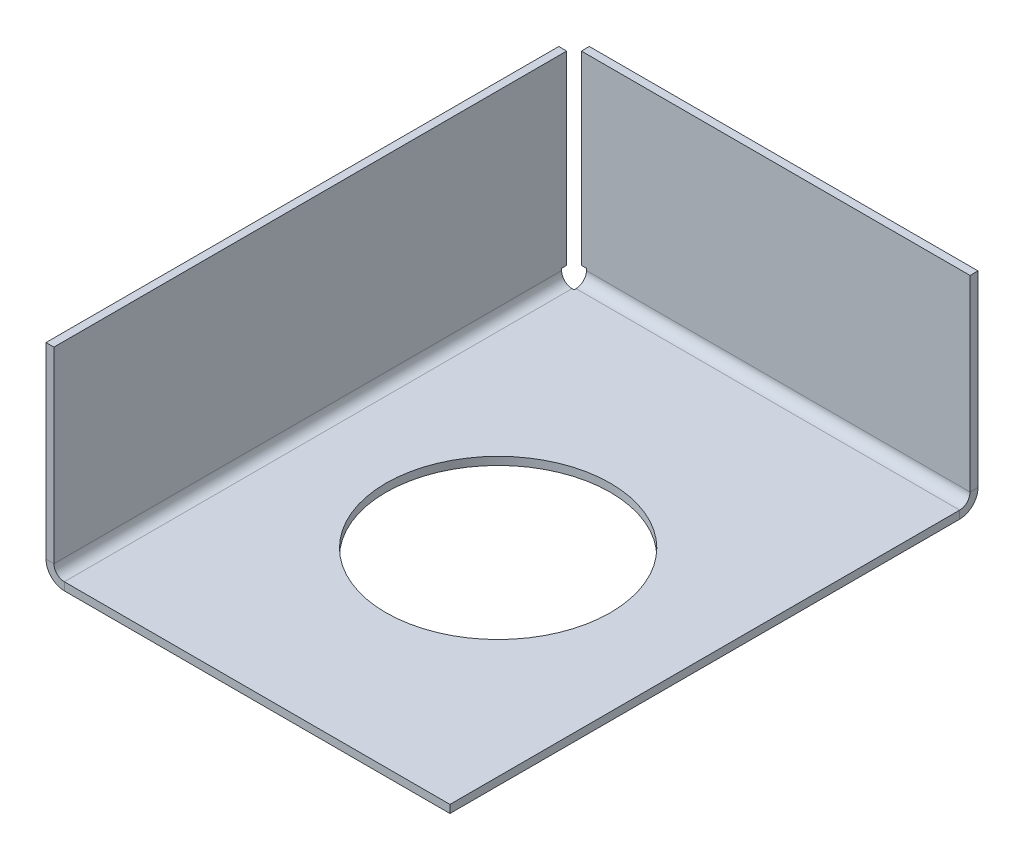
ISO-10303-21;
HEADER;
FILE_DESCRIPTION(('STEP AP214'),'2;1');
FILE_NAME('part.step','',(''),(''),'','','');
FILE_SCHEMA(('AUTOMOTIVE_DESIGN { 1 0 10303 214 1 1 1 1 }'));
ENDSEC;
DATA;
#1=APPLICATION_CONTEXT('core data for automotive mechanical design processes');
#2=APPLICATION_PROTOCOL_DEFINITION('international standard','automotive_design',2000,#1);
#3=PRODUCT_CONTEXT('',#1,'mechanical');
#4=PRODUCT('Part','Part','',(#3));
#5=PRODUCT_RELATED_PRODUCT_CATEGORY('part','',(#4));
#6=PRODUCT_DEFINITION_FORMATION('','',#4);
#7=PRODUCT_DEFINITION_CONTEXT('part definition',#1,'design');
#8=PRODUCT_DEFINITION('design','',#6,#7);
#9=PRODUCT_DEFINITION_SHAPE('','',#8);
#10=(LENGTH_UNIT() NAMED_UNIT(*) SI_UNIT(.MILLI.,.METRE.));
#11=(NAMED_UNIT(*) PLANE_ANGLE_UNIT() SI_UNIT($,.RADIAN.));
#12=(NAMED_UNIT(*) SI_UNIT($,.STERADIAN.) SOLID_ANGLE_UNIT());
#13=UNCERTAINTY_MEASURE_WITH_UNIT(LENGTH_MEASURE(1.E-05),#10,'distance_accuracy_value','');
#14=(GEOMETRIC_REPRESENTATION_CONTEXT(3) GLOBAL_UNCERTAINTY_ASSIGNED_CONTEXT((#13)) GLOBAL_UNIT_ASSIGNED_CONTEXT((#10,
#11,#12)) REPRESENTATION_CONTEXT('',''));
#15=CARTESIAN_POINT('',(0.,0.,0.));
#16=DIRECTION('',(0.,0.,1.));
#17=DIRECTION('',(1.,0.,0.));
#18=AXIS2_PLACEMENT_3D('',#15,#16,#17);
#19=CARTESIAN_POINT('',(0.,0.,1210.96219244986));
#20=DIRECTION('',(0.,0.,1.));
#21=DIRECTION('',(1.,0.,0.));
#22=AXIS2_PLACEMENT_3D('',#19,#20,#21);
#23=PLANE('',#22);
#24=DIRECTION('',(0.,1.,0.));
#25=VECTOR('',#24,1.);
#26=CARTESIAN_POINT('',(92.1994697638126,-33.5211869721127,1210.96219244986));
#27=LINE('',#26,#25);
#28=CARTESIAN_POINT('',(92.1994697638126,-31.5145869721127,1210.96219244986));
#29=VERTEX_POINT('',#28);
#30=CARTESIAN_POINT('',(92.1994697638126,4.57881302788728,1210.96219244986));
#31=VERTEX_POINT('',#30);
#32=EDGE_CURVE('E225',#29,#31,#27,.T.);
#33=ORIENTED_EDGE('',*,*,#32,.F.);
#34=DIRECTION('',(1.,0.,0.));
#35=VECTOR('',#34,1.);
#36=CARTESIAN_POINT('',(92.1994697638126,-31.5145869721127,1210.96219244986));
#37=LINE('',#36,#35);
#38=CARTESIAN_POINT('',(93.7234697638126,-31.5145869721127,1210.96219244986));
#39=VERTEX_POINT('',#38);
#40=EDGE_CURVE('E11',#29,#39,#37,.T.);
#41=ORIENTED_EDGE('',*,*,#40,.T.);
#42=DIRECTION('',(0.,1.,0.));
#43=VECTOR('',#42,1.);
#44=CARTESIAN_POINT('',(93.7234697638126,-33.5211869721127,1210.96219244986));
#45=LINE('',#44,#43);
#46=CARTESIAN_POINT('',(93.7234697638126,4.57881302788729,1210.96219244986));
#47=VERTEX_POINT('',#46);
#48=EDGE_CURVE('E339',#39,#47,#45,.T.);
#49=ORIENTED_EDGE('',*,*,#48,.T.);
#50=DIRECTION('',(-1.,0.,0.));
#51=VECTOR('',#50,1.);
#52=CARTESIAN_POINT('',(93.7234697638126,4.57881302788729,1210.96219244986));
#53=LINE('',#52,#51);
#54=EDGE_CURVE('E344',#31,#47,#53,.F.);
#55=ORIENTED_EDGE('',*,*,#54,.F.);
#56=EDGE_LOOP('',(#33,#41,#49,#55));
#57=FACE_BOUND('',#56,.T.);
#58=ADVANCED_FACE('F41',(#57),#23,.T.);
#59=DIRECTION('',(1.,0.,0.));
#60=VECTOR('',#59,1.);
#61=CARTESIAN_POINT('',(195.323469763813,-33.5211869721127,1210.96219244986));
#62=LINE('',#61,#60);
#63=CARTESIAN_POINT('',(95.7300697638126,-33.5211869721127,1210.96219244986));
#64=VERTEX_POINT('',#63);
#65=CARTESIAN_POINT('',(169.923469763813,-33.5211869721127,1210.96219244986));
#66=VERTEX_POINT('',#65);
#67=EDGE_CURVE('E215',#64,#66,#62,.T.);
#68=ORIENTED_EDGE('',*,*,#67,.F.);
#69=DIRECTION('',(0.,-1.,0.));
#70=VECTOR('',#69,1.);
#71=CARTESIAN_POINT('',(95.7300697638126,-33.5211869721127,1210.96219244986));
#72=LINE('',#71,#70);
#73=CARTESIAN_POINT('',(95.7300697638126,-35.0451869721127,1210.96219244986));
#74=VERTEX_POINT('',#73);
#75=EDGE_CURVE('E49',#64,#74,#72,.T.);
#76=ORIENTED_EDGE('',*,*,#75,.T.);
#77=DIRECTION('',(1.,0.,0.));
#78=VECTOR('',#77,1.);
#79=CARTESIAN_POINT('',(195.323469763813,-35.0451869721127,1210.96219244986));
#80=LINE('',#79,#78);
#81=CARTESIAN_POINT('',(169.923469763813,-35.0451869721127,1210.96219244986));
#82=VERTEX_POINT('',#81);
#83=EDGE_CURVE('E212',#74,#82,#80,.T.);
#84=ORIENTED_EDGE('',*,*,#83,.T.);
#85=DIRECTION('',(0.,-1.,0.));
#86=VECTOR('',#85,1.);
#87=CARTESIAN_POINT('',(169.923469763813,-33.5211869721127,1210.96219244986));
#88=LINE('',#87,#86);
#89=EDGE_CURVE('E123',#66,#82,#88,.T.);
#90=ORIENTED_EDGE('',*,*,#89,.F.);
#91=EDGE_LOOP('',(#68,#76,#84,#90));
#92=FACE_BOUND('',#91,.T.);
#93=ADVANCED_FACE('F211',(#92),#23,.T.);
#94=CARTESIAN_POINT('',(169.923469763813,-33.5211869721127,1212.48619244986));
#95=DIRECTION('',(1.,0.,0.));
#96=DIRECTION('',(0.,0.,-1.));
#97=AXIS2_PLACEMENT_3D('',#94,#95,#96);
#98=PLANE('',#97);
#99=DIRECTION('',(0.,0.,-1.));
#100=VECTOR('',#99,1.);
#101=CARTESIAN_POINT('',(169.923469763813,-33.5211869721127,1212.48619244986));
#102=LINE('',#101,#100);
#103=CARTESIAN_POINT('',(169.923469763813,-33.5211869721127,1112.89279244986));
#104=VERTEX_POINT('',#103);
#105=EDGE_CURVE('E304',#66,#104,#102,.T.);
#106=ORIENTED_EDGE('',*,*,#105,.F.);
#107=ORIENTED_EDGE('',*,*,#89,.T.);
#108=DIRECTION('',(0.,0.,1.));
#109=VECTOR('',#108,1.);
#110=CARTESIAN_POINT('',(169.923469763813,-35.0451869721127,5.98619244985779));
#111=LINE('',#110,#109);
#112=CARTESIAN_POINT('',(169.923469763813,-35.0451869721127,1112.89279244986));
#113=VERTEX_POINT('',#112);
#114=EDGE_CURVE('E115',#82,#113,#111,.F.);
#115=ORIENTED_EDGE('',*,*,#114,.T.);
#116=DIRECTION('',(0.,1.,0.));
#117=VECTOR('',#116,1.);
#118=CARTESIAN_POINT('',(169.923469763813,-33.5211869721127,1112.89279244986));
#119=LINE('',#118,#117);
#120=EDGE_CURVE('E120',#113,#104,#119,.T.);
#121=ORIENTED_EDGE('',*,*,#120,.T.);
#122=EDGE_LOOP('',(#106,#107,#115,#121));
#123=FACE_BOUND('',#122,.T.);
#124=ADVANCED_FACE('F118',(#123),#98,.T.);
#125=CARTESIAN_POINT('',(93.7234697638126,4.57881302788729,1212.48619244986));
#126=DIRECTION('',(0.,-1.,0.));
#127=DIRECTION('',(0.,0.,1.));
#128=AXIS2_PLACEMENT_3D('',#125,#126,#127);
#129=PLANE('',#128);
#130=DIRECTION('',(0.,0.,1.));
#131=VECTOR('',#130,1.);
#132=CARTESIAN_POINT('',(92.1994697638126,4.57881302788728,1212.48619244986));
#133=LINE('',#132,#131);
#134=CARTESIAN_POINT('',(92.1994697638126,4.57881302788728,1112.30040601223));
#135=VERTEX_POINT('',#134);
#136=EDGE_CURVE('E239',#135,#31,#133,.T.);
#137=ORIENTED_EDGE('',*,*,#136,.T.);
#138=ORIENTED_EDGE('',*,*,#54,.T.);
#139=DIRECTION('',(0.,0.,1.));
#140=VECTOR('',#139,1.);
#141=CARTESIAN_POINT('',(93.7234697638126,4.57881302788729,1212.48619244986));
#142=LINE('',#141,#140);
#143=CARTESIAN_POINT('',(93.7234697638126,4.57881302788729,1112.30040601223));
#144=VERTEX_POINT('',#143);
#145=EDGE_CURVE('E275',#144,#47,#142,.T.);
#146=ORIENTED_EDGE('',*,*,#145,.F.);
#147=DIRECTION('',(1.,0.,0.));
#148=VECTOR('',#147,1.);
#149=CARTESIAN_POINT('',(93.7234697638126,4.57881302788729,1112.30040601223));
#150=LINE('',#149,#148);
#151=EDGE_CURVE('E167',#135,#144,#150,.T.);
#152=ORIENTED_EDGE('',*,*,#151,.F.);
#153=EDGE_LOOP('',(#137,#138,#146,#152));
#154=FACE_BOUND('',#153,.T.);
#155=ADVANCED_FACE('F359',(#154),#129,.F.);
#156=CARTESIAN_POINT('',(93.7234697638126,-33.5211869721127,1212.48619244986));
#157=DIRECTION('',(-1.,0.,0.));
#158=DIRECTION('',(0.,0.,1.));
#159=AXIS2_PLACEMENT_3D('',#156,#157,#158);
#160=PLANE('',#159);
#161=ORIENTED_EDGE('',*,*,#48,.F.);
#162=DIRECTION('',(0.,0.,1.));
#163=VECTOR('',#162,1.);
#164=CARTESIAN_POINT('',(93.7234697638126,-31.5145869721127,1212.48619244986));
#165=LINE('',#164,#163);
#166=CARTESIAN_POINT('',(93.7234697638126,-31.5145869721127,1113.27379244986));
#167=VERTEX_POINT('',#166);
#168=EDGE_CURVE('E290',#39,#167,#165,.F.);
#169=ORIENTED_EDGE('',*,*,#168,.T.);
#170=DIRECTION('',(0.,1.,0.));
#171=VECTOR('',#170,1.);
#172=CARTESIAN_POINT('',(93.7234697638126,-33.5211869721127,1113.27379244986));
#173=LINE('',#172,#171);
#174=CARTESIAN_POINT('',(93.7234697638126,-31.1335869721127,1113.27379244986));
#175=VERTEX_POINT('',#174);
#176=EDGE_CURVE('E312',#167,#175,#173,.T.);
#177=ORIENTED_EDGE('',*,*,#176,.T.);
#178=DIRECTION('',(0.,0.,-1.));
#179=VECTOR('',#178,1.);
#180=CARTESIAN_POINT('',(93.7234697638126,-31.1335869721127,1212.48619244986));
#181=LINE('',#180,#179);
#182=CARTESIAN_POINT('',(93.7234697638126,-31.1335869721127,1112.30040601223));
#183=VERTEX_POINT('',#182);
#184=EDGE_CURVE('E313',#175,#183,#181,.T.);
#185=ORIENTED_EDGE('',*,*,#184,.T.);
#186=DIRECTION('',(0.,1.,0.));
#187=VECTOR('',#186,1.);
#188=CARTESIAN_POINT('',(93.7234697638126,4.57881302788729,1112.30040601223));
#189=LINE('',#188,#187);
#190=EDGE_CURVE('E330',#183,#144,#189,.T.);
#191=ORIENTED_EDGE('',*,*,#190,.T.);
#192=ORIENTED_EDGE('',*,*,#145,.T.);
#193=EDGE_LOOP('',(#161,#169,#177,#185,#191,#192));
#194=FACE_BOUND('',#193,.T.);
#195=ADVANCED_FACE('F370',(#194),#160,.F.);
#196=CARTESIAN_POINT('',(195.323469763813,-33.5211869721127,5.98619244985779));
#197=DIRECTION('',(0.,1.,0.));
#198=DIRECTION('',(0.,0.,1.));
#199=AXIS2_PLACEMENT_3D('',#196,#197,#198);
#200=PLANE('',#199);
#201=CARTESIAN_POINT('',(131.823469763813,-33.5211869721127,1163.59119244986));
#202=DIRECTION('',(0.,1.,0.));
#203=DIRECTION('',(0.,0.,1.));
#204=AXIS2_PLACEMENT_3D('',#201,#202,#203);
#205=CIRCLE('',#204,21.59);
#206=CARTESIAN_POINT('',(131.823469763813,-33.5211869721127,1185.18119244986));
#207=VERTEX_POINT('',#206);
#208=EDGE_CURVE('E296',#207,#207,#205,.T.);
#209=ORIENTED_EDGE('',*,*,#208,.F.);
#210=EDGE_LOOP('',(#209));
#211=FACE_BOUND('',#210,.T.);
#212=DIRECTION('',(0.,0.,1.));
#213=VECTOR('',#212,1.);
#214=CARTESIAN_POINT('',(95.7300697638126,-33.5211869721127,5.98619244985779));
#215=LINE('',#214,#213);
#216=CARTESIAN_POINT('',(95.7300697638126,-33.5211869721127,1113.27379244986));
#217=VERTEX_POINT('',#216);
#218=EDGE_CURVE('E309',#217,#64,#215,.T.);
#219=ORIENTED_EDGE('',*,*,#218,.T.);
#220=ORIENTED_EDGE('',*,*,#67,.T.);
#221=ORIENTED_EDGE('',*,*,#105,.T.);
#222=DIRECTION('',(-1.,0.,0.));
#223=VECTOR('',#222,1.);
#224=CARTESIAN_POINT('',(195.323469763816,-33.5211869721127,1112.89279244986));
#225=LINE('',#224,#223);
#226=CARTESIAN_POINT('',(96.1110697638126,-33.5211869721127,1112.89279244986));
#227=VERTEX_POINT('',#226);
#228=EDGE_CURVE('E287',#104,#227,#225,.T.);
#229=ORIENTED_EDGE('',*,*,#228,.T.);
#230=DIRECTION('',(0.,0.,-1.));
#231=VECTOR('',#230,1.);
#232=CARTESIAN_POINT('',(96.1110697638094,-33.5211869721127,5.98619244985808));
#233=LINE('',#232,#231);
#234=CARTESIAN_POINT('',(96.1110697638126,-33.5211869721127,1113.27379244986));
#235=VERTEX_POINT('',#234);
#236=EDGE_CURVE('E324',#235,#227,#233,.T.);
#237=ORIENTED_EDGE('',*,*,#236,.F.);
#238=DIRECTION('',(1.,0.,0.));
#239=VECTOR('',#238,1.);
#240=CARTESIAN_POINT('',(195.323469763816,-33.5211869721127,1113.27379244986));
#241=LINE('',#240,#239);
#242=EDGE_CURVE('E321',#217,#235,#241,.T.);
#243=ORIENTED_EDGE('',*,*,#242,.F.);
#244=EDGE_LOOP('',(#219,#220,#221,#229,#237,#243));
#245=FACE_BOUND('',#244,.T.);
#246=ADVANCED_FACE('F394',(#211,#245),#200,.T.);
#247=CARTESIAN_POINT('',(95.7300697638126,-31.5145869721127,5.98619244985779));
#248=DIRECTION('',(0.,0.,1.));
#249=DIRECTION('',(1.,0.,0.));
#250=AXIS2_PLACEMENT_3D('',#247,#248,#249);
#251=CYLINDRICAL_SURFACE('',#250,2.0066);
#252=CARTESIAN_POINT('',(95.7300697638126,-31.5145869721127,1210.96219244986));
#253=DIRECTION('',(0.,0.,1.));
#254=DIRECTION('',(1.,0.,0.));
#255=AXIS2_PLACEMENT_3D('',#252,#253,#254);
#256=CIRCLE('',#255,2.0066);
#257=EDGE_CURVE('E159',#64,#39,#256,.F.);
#258=ORIENTED_EDGE('',*,*,#257,.F.);
#259=ORIENTED_EDGE('',*,*,#218,.F.);
#260=CARTESIAN_POINT('',(95.7300697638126,-31.5145869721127,1113.27379244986));
#261=DIRECTION('',(0.,0.,-1.));
#262=DIRECTION('',(-1.,0.,0.));
#263=AXIS2_PLACEMENT_3D('',#260,#261,#262);
#264=CIRCLE('',#263,2.0066);
#265=EDGE_CURVE('E294',#217,#167,#264,.T.);
#266=ORIENTED_EDGE('',*,*,#265,.T.);
#267=ORIENTED_EDGE('',*,*,#168,.F.);
#268=EDGE_LOOP('',(#258,#259,#266,#267));
#269=FACE_BOUND('',#268,.T.);
#270=ADVANCED_FACE('F573',(#269),#251,.F.);
#271=CARTESIAN_POINT('',(92.1994697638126,-33.5211869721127,1212.48619244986));
#272=DIRECTION('',(-1.,0.,0.));
#273=DIRECTION('',(0.,0.,1.));
#274=AXIS2_PLACEMENT_3D('',#271,#272,#273);
#275=PLANE('',#274);
#276=DIRECTION('',(0.,0.,1.));
#277=VECTOR('',#276,1.);
#278=CARTESIAN_POINT('',(92.1994697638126,-31.5145869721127,1212.48619244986));
#279=LINE('',#278,#277);
#280=CARTESIAN_POINT('',(92.1994697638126,-31.5145869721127,1113.27379244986));
#281=VERTEX_POINT('',#280);
#282=EDGE_CURVE('E148',#29,#281,#279,.F.);
#283=ORIENTED_EDGE('',*,*,#282,.F.);
#284=ORIENTED_EDGE('',*,*,#32,.T.);
#285=ORIENTED_EDGE('',*,*,#136,.F.);
#286=DIRECTION('',(0.,1.,0.));
#287=VECTOR('',#286,1.);
#288=CARTESIAN_POINT('',(92.1994697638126,-33.5211869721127,1112.30040601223));
#289=LINE('',#288,#287);
#290=CARTESIAN_POINT('',(92.1994697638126,-31.1335869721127,1112.30040601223));
#291=VERTEX_POINT('',#290);
#292=EDGE_CURVE('E242',#291,#135,#289,.T.);
#293=ORIENTED_EDGE('',*,*,#292,.F.);
#294=DIRECTION('',(0.,0.,1.));
#295=VECTOR('',#294,1.);
#296=CARTESIAN_POINT('',(92.1994697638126,-31.1335869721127,1212.48619244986));
#297=LINE('',#296,#295);
#298=CARTESIAN_POINT('',(92.1994697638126,-31.1335869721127,1113.27379244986));
#299=VERTEX_POINT('',#298);
#300=EDGE_CURVE('E233',#299,#291,#297,.F.);
#301=ORIENTED_EDGE('',*,*,#300,.F.);
#302=DIRECTION('',(0.,1.,0.));
#303=VECTOR('',#302,1.);
#304=CARTESIAN_POINT('',(92.1994697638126,-33.5211869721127,1113.27379244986));
#305=LINE('',#304,#303);
#306=EDGE_CURVE('E229',#281,#299,#305,.T.);
#307=ORIENTED_EDGE('',*,*,#306,.F.);
#308=EDGE_LOOP('',(#283,#284,#285,#293,#301,#307));
#309=FACE_BOUND('',#308,.T.);
#310=ADVANCED_FACE('F351',(#309),#275,.T.);
#311=CARTESIAN_POINT('',(195.323469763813,-35.0451869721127,5.98619244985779));
#312=DIRECTION('',(0.,1.,0.));
#313=DIRECTION('',(0.,0.,1.));
#314=AXIS2_PLACEMENT_3D('',#311,#312,#313);
#315=PLANE('',#314);
#316=CARTESIAN_POINT('',(131.823469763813,-35.0451869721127,1163.59119244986));
#317=DIRECTION('',(0.,1.,0.));
#318=DIRECTION('',(0.,0.,1.));
#319=AXIS2_PLACEMENT_3D('',#316,#317,#318);
#320=CIRCLE('',#319,21.59);
#321=CARTESIAN_POINT('',(131.823469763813,-35.0451869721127,1185.18119244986));
#322=VERTEX_POINT('',#321);
#323=EDGE_CURVE('E128',#322,#322,#320,.T.);
#324=ORIENTED_EDGE('',*,*,#323,.T.);
#325=EDGE_LOOP('',(#324));
#326=FACE_BOUND('',#325,.T.);
#327=ORIENTED_EDGE('',*,*,#83,.F.);
#328=DIRECTION('',(0.,0.,1.));
#329=VECTOR('',#328,1.);
#330=CARTESIAN_POINT('',(95.7300697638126,-35.0451869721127,5.98619244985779));
#331=LINE('',#330,#329);
#332=CARTESIAN_POINT('',(95.7300697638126,-35.0451869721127,1113.27379244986));
#333=VERTEX_POINT('',#332);
#334=EDGE_CURVE('E223',#333,#74,#331,.T.);
#335=ORIENTED_EDGE('',*,*,#334,.F.);
#336=DIRECTION('',(1.,0.,0.));
#337=VECTOR('',#336,1.);
#338=CARTESIAN_POINT('',(195.323469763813,-35.0451869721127,1113.27379244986));
#339=LINE('',#338,#337);
#340=CARTESIAN_POINT('',(96.1110697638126,-35.0451869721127,1113.27379244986));
#341=VERTEX_POINT('',#340);
#342=EDGE_CURVE('E249',#333,#341,#339,.T.);
#343=ORIENTED_EDGE('',*,*,#342,.T.);
#344=DIRECTION('',(0.,0.,1.));
#345=VECTOR('',#344,1.);
#346=CARTESIAN_POINT('',(96.1110697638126,-35.0451869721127,5.98619244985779));
#347=LINE('',#346,#345);
#348=CARTESIAN_POINT('',(96.1110697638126,-35.0451869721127,1112.89279244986));
#349=VERTEX_POINT('',#348);
#350=EDGE_CURVE('E143',#341,#349,#347,.F.);
#351=ORIENTED_EDGE('',*,*,#350,.T.);
#352=DIRECTION('',(1.,0.,0.));
#353=VECTOR('',#352,1.);
#354=CARTESIAN_POINT('',(195.323469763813,-35.0451869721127,1112.89279244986));
#355=LINE('',#354,#353);
#356=EDGE_CURVE('E139',#113,#349,#355,.F.);
#357=ORIENTED_EDGE('',*,*,#356,.F.);
#358=ORIENTED_EDGE('',*,*,#114,.F.);
#359=EDGE_LOOP('',(#327,#335,#343,#351,#357,#358));
#360=FACE_BOUND('',#359,.T.);
#361=ADVANCED_FACE('F140',(#326,#360),#315,.F.);
#362=CARTESIAN_POINT('',(95.7300697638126,-31.5145869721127,5.98619244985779));
#363=DIRECTION('',(0.,0.,1.));
#364=DIRECTION('',(1.,0.,0.));
#365=AXIS2_PLACEMENT_3D('',#362,#363,#364);
#366=CYLINDRICAL_SURFACE('',#365,3.5306);
#367=ORIENTED_EDGE('',*,*,#334,.T.);
#368=CARTESIAN_POINT('',(95.7300697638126,-31.5145869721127,1210.96219244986));
#369=DIRECTION('',(0.,0.,1.));
#370=DIRECTION('',(1.,0.,0.));
#371=AXIS2_PLACEMENT_3D('',#368,#369,#370);
#372=CIRCLE('',#371,3.5306);
#373=EDGE_CURVE('E135',#74,#29,#372,.F.);
#374=ORIENTED_EDGE('',*,*,#373,.T.);
#375=ORIENTED_EDGE('',*,*,#282,.T.);
#376=CARTESIAN_POINT('',(95.7300697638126,-31.5145869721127,1113.27379244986));
#377=DIRECTION('',(0.,0.,1.));
#378=DIRECTION('',(1.,0.,0.));
#379=AXIS2_PLACEMENT_3D('',#376,#377,#378);
#380=CIRCLE('',#379,3.5306);
#381=EDGE_CURVE('E154',#333,#281,#380,.F.);
#382=ORIENTED_EDGE('',*,*,#381,.F.);
#383=EDGE_LOOP('',(#367,#374,#375,#382));
#384=FACE_BOUND('',#383,.T.);
#385=ADVANCED_FACE('F227',(#384),#366,.T.);
#386=CARTESIAN_POINT('',(169.923469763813,-31.5145869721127,1112.89279244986));
#387=DIRECTION('',(-1.,0.,0.));
#388=DIRECTION('',(0.,0.,1.));
#389=AXIS2_PLACEMENT_3D('',#386,#387,#388);
#390=PLANE('',#389);
#391=ORIENTED_EDGE('',*,*,#120,.F.);
#392=CARTESIAN_POINT('',(169.923469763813,-31.5145869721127,1112.89279244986));
#393=DIRECTION('',(-1.,0.,0.));
#394=DIRECTION('',(0.,0.,1.));
#395=AXIS2_PLACEMENT_3D('',#392,#393,#394);
#396=CIRCLE('',#395,3.5306);
#397=CARTESIAN_POINT('',(169.923469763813,-31.5145869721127,1109.36219244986));
#398=VERTEX_POINT('',#397);
#399=EDGE_CURVE('E132',#113,#398,#396,.F.);
#400=ORIENTED_EDGE('',*,*,#399,.T.);
#401=DIRECTION('',(0.,0.,1.));
#402=VECTOR('',#401,1.);
#403=CARTESIAN_POINT('',(169.923469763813,-31.5145869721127,1110.88619244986));
#404=LINE('',#403,#402);
#405=CARTESIAN_POINT('',(169.923469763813,-31.5145869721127,1110.88619244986));
#406=VERTEX_POINT('',#405);
#407=EDGE_CURVE('E63',#398,#406,#404,.T.);
#408=ORIENTED_EDGE('',*,*,#407,.T.);
#409=CARTESIAN_POINT('',(169.923469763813,-31.5145869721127,1112.89279244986));
#410=DIRECTION('',(1.,0.,0.));
#411=DIRECTION('',(0.,0.,-1.));
#412=AXIS2_PLACEMENT_3D('',#409,#410,#411);
#413=CIRCLE('',#412,2.0066);
#414=EDGE_CURVE('E133',#104,#406,#413,.T.);
#415=ORIENTED_EDGE('',*,*,#414,.F.);
#416=EDGE_LOOP('',(#391,#400,#408,#415));
#417=FACE_BOUND('',#416,.T.);
#418=ADVANCED_FACE('F130',(#417),#390,.F.);
#419=CARTESIAN_POINT('',(169.923469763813,4.57881302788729,1110.88619244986));
#420=DIRECTION('',(1.,0.,0.));
#421=DIRECTION('',(0.,-1.,0.));
#422=AXIS2_PLACEMENT_3D('',#419,#420,#421);
#423=PLANE('',#422);
#424=ORIENTED_EDGE('',*,*,#407,.F.);
#425=DIRECTION('',(0.,1.,0.));
#426=VECTOR('',#425,1.);
#427=CARTESIAN_POINT('',(169.923469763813,-33.5211869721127,1109.36219244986));
#428=LINE('',#427,#426);
#429=CARTESIAN_POINT('',(169.923469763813,4.57881302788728,1109.36219244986));
#430=VERTEX_POINT('',#429);
#431=EDGE_CURVE('E162',#430,#398,#428,.F.);
#432=ORIENTED_EDGE('',*,*,#431,.F.);
#433=DIRECTION('',(0.,0.,1.));
#434=VECTOR('',#433,1.);
#435=CARTESIAN_POINT('',(169.923469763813,4.57881302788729,1110.88619244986));
#436=LINE('',#435,#434);
#437=CARTESIAN_POINT('',(169.923469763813,4.57881302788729,1110.88619244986));
#438=VERTEX_POINT('',#437);
#439=EDGE_CURVE('E200',#430,#438,#436,.T.);
#440=ORIENTED_EDGE('',*,*,#439,.T.);
#441=DIRECTION('',(0.,-1.,0.));
#442=VECTOR('',#441,1.);
#443=CARTESIAN_POINT('',(169.923469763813,4.57881302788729,1110.88619244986));
#444=LINE('',#443,#442);
#445=EDGE_CURVE('E270',#438,#406,#444,.T.);
#446=ORIENTED_EDGE('',*,*,#445,.T.);
#447=EDGE_LOOP('',(#424,#432,#440,#446));
#448=FACE_BOUND('',#447,.T.);
#449=ADVANCED_FACE('F267',(#448),#423,.T.);
#450=CARTESIAN_POINT('',(169.923469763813,4.57881302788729,1110.88619244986));
#451=DIRECTION('',(0.,-1.,0.));
#452=DIRECTION('',(-1.,0.,0.));
#453=AXIS2_PLACEMENT_3D('',#450,#451,#452);
#454=PLANE('',#453);
#455=ORIENTED_EDGE('',*,*,#439,.F.);
#456=DIRECTION('',(-1.,0.,0.));
#457=VECTOR('',#456,1.);
#458=CARTESIAN_POINT('',(169.923469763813,4.57881302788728,1109.36219244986));
#459=LINE('',#458,#457);
#460=CARTESIAN_POINT('',(95.1376833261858,4.57881302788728,1109.36219244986));
#461=VERTEX_POINT('',#460);
#462=EDGE_CURVE('E127',#430,#461,#459,.T.);
#463=ORIENTED_EDGE('',*,*,#462,.T.);
#464=DIRECTION('',(0.,0.,1.));
#465=VECTOR('',#464,1.);
#466=CARTESIAN_POINT('',(95.1376833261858,4.57881302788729,1110.88619244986));
#467=LINE('',#466,#465);
#468=CARTESIAN_POINT('',(95.1376833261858,4.57881302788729,1110.88619244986));
#469=VERTEX_POINT('',#468);
#470=EDGE_CURVE('E197',#461,#469,#467,.T.);
#471=ORIENTED_EDGE('',*,*,#470,.T.);
#472=DIRECTION('',(-1.,0.,0.));
#473=VECTOR('',#472,1.);
#474=CARTESIAN_POINT('',(169.923469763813,4.57881302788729,1110.88619244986));
#475=LINE('',#474,#473);
#476=EDGE_CURVE('E276',#438,#469,#475,.T.);
#477=ORIENTED_EDGE('',*,*,#476,.F.);
#478=EDGE_LOOP('',(#455,#463,#471,#477));
#479=FACE_BOUND('',#478,.T.);
#480=ADVANCED_FACE('F414',(#479),#454,.F.);
#481=CARTESIAN_POINT('',(95.1376833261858,-33.5211869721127,1110.88619244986));
#482=DIRECTION('',(1.,0.,0.));
#483=DIRECTION('',(0.,-1.,0.));
#484=AXIS2_PLACEMENT_3D('',#481,#482,#483);
#485=PLANE('',#484);
#486=ORIENTED_EDGE('',*,*,#470,.F.);
#487=DIRECTION('',(0.,1.,0.));
#488=VECTOR('',#487,1.);
#489=CARTESIAN_POINT('',(95.1376833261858,-33.5211869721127,1109.36219244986));
#490=LINE('',#489,#488);
#491=CARTESIAN_POINT('',(95.1376833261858,-31.1335869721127,1109.36219244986));
#492=VERTEX_POINT('',#491);
#493=EDGE_CURVE('E245',#461,#492,#490,.F.);
#494=ORIENTED_EDGE('',*,*,#493,.T.);
#495=DIRECTION('',(0.,0.,1.));
#496=VECTOR('',#495,1.);
#497=CARTESIAN_POINT('',(95.1376833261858,-31.1335869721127,1110.88619244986));
#498=LINE('',#497,#496);
#499=CARTESIAN_POINT('',(95.1376833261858,-31.1335869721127,1110.88619244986));
#500=VERTEX_POINT('',#499);
#501=EDGE_CURVE('E194',#492,#500,#498,.T.);
#502=ORIENTED_EDGE('',*,*,#501,.T.);
#503=DIRECTION('',(0.,-1.,0.));
#504=VECTOR('',#503,1.);
#505=CARTESIAN_POINT('',(95.1376833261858,-33.5211869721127,1110.88619244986));
#506=LINE('',#505,#504);
#507=EDGE_CURVE('E327',#469,#500,#506,.T.);
#508=ORIENTED_EDGE('',*,*,#507,.F.);
#509=EDGE_LOOP('',(#486,#494,#502,#508));
#510=FACE_BOUND('',#509,.T.);
#511=ADVANCED_FACE('F413',(#510),#485,.F.);
#512=CARTESIAN_POINT('',(169.923469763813,-31.1335869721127,1110.88619244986));
#513=DIRECTION('',(0.,1.,0.));
#514=DIRECTION('',(1.,0.,0.));
#515=AXIS2_PLACEMENT_3D('',#512,#513,#514);
#516=PLANE('',#515);
#517=ORIENTED_EDGE('',*,*,#501,.F.);
#518=DIRECTION('',(-1.,0.,0.));
#519=VECTOR('',#518,1.);
#520=CARTESIAN_POINT('',(169.923469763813,-31.1335869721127,1109.36219244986));
#521=LINE('',#520,#519);
#522=CARTESIAN_POINT('',(96.1110697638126,-31.1335869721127,1109.36219244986));
#523=VERTEX_POINT('',#522);
#524=EDGE_CURVE('E251',#492,#523,#521,.F.);
#525=ORIENTED_EDGE('',*,*,#524,.T.);
#526=DIRECTION('',(0.,0.,1.));
#527=VECTOR('',#526,1.);
#528=CARTESIAN_POINT('',(96.1110697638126,-31.1335869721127,1110.88619244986));
#529=LINE('',#528,#527);
#530=CARTESIAN_POINT('',(96.1110697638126,-31.1335869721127,1110.88619244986));
#531=VERTEX_POINT('',#530);
#532=EDGE_CURVE('E191',#523,#531,#529,.T.);
#533=ORIENTED_EDGE('',*,*,#532,.T.);
#534=DIRECTION('',(1.,0.,0.));
#535=VECTOR('',#534,1.);
#536=CARTESIAN_POINT('',(169.923469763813,-31.1335869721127,1110.88619244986));
#537=LINE('',#536,#535);
#538=EDGE_CURVE('E319',#500,#531,#537,.T.);
#539=ORIENTED_EDGE('',*,*,#538,.F.);
#540=EDGE_LOOP('',(#517,#525,#533,#539));
#541=FACE_BOUND('',#540,.T.);
#542=ADVANCED_FACE('F407',(#541),#516,.F.);
#543=CARTESIAN_POINT('',(96.1110697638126,-33.5211869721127,1110.88619244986));
#544=DIRECTION('',(1.,0.,0.));
#545=DIRECTION('',(0.,-1.,0.));
#546=AXIS2_PLACEMENT_3D('',#543,#544,#545);
#547=PLANE('',#546);
#548=ORIENTED_EDGE('',*,*,#532,.F.);
#549=DIRECTION('',(0.,1.,0.));
#550=VECTOR('',#549,1.);
#551=CARTESIAN_POINT('',(96.1110697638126,-33.5211869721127,1109.36219244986));
#552=LINE('',#551,#550);
#553=CARTESIAN_POINT('',(96.1110697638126,-31.5145869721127,1109.36219244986));
#554=VERTEX_POINT('',#553);
#555=EDGE_CURVE('E247',#523,#554,#552,.F.);
#556=ORIENTED_EDGE('',*,*,#555,.T.);
#557=DIRECTION('',(0.,0.,1.));
#558=VECTOR('',#557,1.);
#559=CARTESIAN_POINT('',(96.1110697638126,-31.5145869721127,1110.88619244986));
#560=LINE('',#559,#558);
#561=CARTESIAN_POINT('',(96.1110697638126,-31.5145869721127,1110.88619244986));
#562=VERTEX_POINT('',#561);
#563=EDGE_CURVE('E189',#554,#562,#560,.T.);
#564=ORIENTED_EDGE('',*,*,#563,.T.);
#565=DIRECTION('',(0.,-1.,0.));
#566=VECTOR('',#565,1.);
#567=CARTESIAN_POINT('',(96.1110697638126,-33.5211869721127,1110.88619244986));
#568=LINE('',#567,#566);
#569=EDGE_CURVE('E283',#531,#562,#568,.T.);
#570=ORIENTED_EDGE('',*,*,#569,.F.);
#571=EDGE_LOOP('',(#548,#556,#564,#570));
#572=FACE_BOUND('',#571,.T.);
#573=ADVANCED_FACE('F411',(#572),#547,.F.);
#574=CARTESIAN_POINT('',(96.1110697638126,-31.5145869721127,1112.89279244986));
#575=DIRECTION('',(1.,0.,0.));
#576=DIRECTION('',(0.,0.,-1.));
#577=AXIS2_PLACEMENT_3D('',#574,#575,#576);
#578=PLANE('',#577);
#579=ORIENTED_EDGE('',*,*,#563,.F.);
#580=CARTESIAN_POINT('',(96.1110697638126,-31.5145869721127,1112.89279244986));
#581=DIRECTION('',(-1.,0.,0.));
#582=DIRECTION('',(0.,0.,1.));
#583=AXIS2_PLACEMENT_3D('',#580,#581,#582);
#584=CIRCLE('',#583,3.5306);
#585=EDGE_CURVE('E155',#554,#349,#584,.T.);
#586=ORIENTED_EDGE('',*,*,#585,.T.);
#587=DIRECTION('',(0.,1.,0.));
#588=VECTOR('',#587,1.);
#589=CARTESIAN_POINT('',(96.1110697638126,-33.5211869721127,1112.89279244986));
#590=LINE('',#589,#588);
#591=EDGE_CURVE('E186',#349,#227,#590,.T.);
#592=ORIENTED_EDGE('',*,*,#591,.T.);
#593=CARTESIAN_POINT('',(96.1110697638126,-31.5145869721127,1112.89279244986));
#594=DIRECTION('',(-1.,0.,0.));
#595=DIRECTION('',(0.,0.,1.));
#596=AXIS2_PLACEMENT_3D('',#593,#594,#595);
#597=CIRCLE('',#596,2.0066);
#598=EDGE_CURVE('E238',#562,#227,#597,.T.);
#599=ORIENTED_EDGE('',*,*,#598,.F.);
#600=EDGE_LOOP('',(#579,#586,#592,#599));
#601=FACE_BOUND('',#600,.T.);
#602=ADVANCED_FACE('F386',(#601),#578,.F.);
#603=CARTESIAN_POINT('',(96.1110697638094,-33.5211869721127,5.98619244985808));
#604=DIRECTION('',(1.,0.,0.));
#605=DIRECTION('',(0.,0.,-1.));
#606=AXIS2_PLACEMENT_3D('',#603,#604,#605);
#607=PLANE('',#606);
#608=ORIENTED_EDGE('',*,*,#591,.F.);
#609=ORIENTED_EDGE('',*,*,#350,.F.);
#610=DIRECTION('',(0.,1.,0.));
#611=VECTOR('',#610,1.);
#612=CARTESIAN_POINT('',(96.1110697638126,-33.5211869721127,1113.27379244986));
#613=LINE('',#612,#611);
#614=EDGE_CURVE('E183',#341,#235,#613,.T.);
#615=ORIENTED_EDGE('',*,*,#614,.T.);
#616=ORIENTED_EDGE('',*,*,#236,.T.);
#617=EDGE_LOOP('',(#608,#609,#615,#616));
#618=FACE_BOUND('',#617,.T.);
#619=ADVANCED_FACE('F390',(#618),#607,.F.);
#620=CARTESIAN_POINT('',(195.323469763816,-33.5211869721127,1113.27379244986));
#621=DIRECTION('',(0.,0.,1.));
#622=DIRECTION('',(1.,0.,0.));
#623=AXIS2_PLACEMENT_3D('',#620,#621,#622);
#624=PLANE('',#623);
#625=ORIENTED_EDGE('',*,*,#614,.F.);
#626=ORIENTED_EDGE('',*,*,#342,.F.);
#627=DIRECTION('',(0.,1.,0.));
#628=VECTOR('',#627,1.);
#629=CARTESIAN_POINT('',(95.7300697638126,-33.5211869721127,1113.27379244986));
#630=LINE('',#629,#628);
#631=EDGE_CURVE('E180',#333,#217,#630,.T.);
#632=ORIENTED_EDGE('',*,*,#631,.T.);
#633=ORIENTED_EDGE('',*,*,#242,.T.);
#634=EDGE_LOOP('',(#625,#626,#632,#633));
#635=FACE_BOUND('',#634,.T.);
#636=ADVANCED_FACE('F453',(#635),#624,.F.);
#637=CARTESIAN_POINT('',(95.7300697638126,-31.5145869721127,1113.27379244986));
#638=DIRECTION('',(0.,0.,1.));
#639=DIRECTION('',(1.,0.,0.));
#640=AXIS2_PLACEMENT_3D('',#637,#638,#639);
#641=PLANE('',#640);
#642=ORIENTED_EDGE('',*,*,#631,.F.);
#643=ORIENTED_EDGE('',*,*,#381,.T.);
#644=DIRECTION('',(1.,0.,0.));
#645=VECTOR('',#644,1.);
#646=CARTESIAN_POINT('',(93.7234697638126,-31.5145869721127,1113.27379244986));
#647=LINE('',#646,#645);
#648=EDGE_CURVE('E177',#281,#167,#647,.T.);
#649=ORIENTED_EDGE('',*,*,#648,.T.);
#650=ORIENTED_EDGE('',*,*,#265,.F.);
#651=EDGE_LOOP('',(#642,#643,#649,#650));
#652=FACE_BOUND('',#651,.T.);
#653=ADVANCED_FACE('F450',(#652),#641,.F.);
#654=CARTESIAN_POINT('',(93.7234697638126,-33.5211869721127,1113.27379244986));
#655=DIRECTION('',(0.,0.,1.));
#656=DIRECTION('',(0.,1.,0.));
#657=AXIS2_PLACEMENT_3D('',#654,#655,#656);
#658=PLANE('',#657);
#659=ORIENTED_EDGE('',*,*,#648,.F.);
#660=ORIENTED_EDGE('',*,*,#306,.T.);
#661=DIRECTION('',(1.,0.,0.));
#662=VECTOR('',#661,1.);
#663=CARTESIAN_POINT('',(93.7234697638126,-31.1335869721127,1113.27379244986));
#664=LINE('',#663,#662);
#665=EDGE_CURVE('E174',#299,#175,#664,.T.);
#666=ORIENTED_EDGE('',*,*,#665,.T.);
#667=ORIENTED_EDGE('',*,*,#176,.F.);
#668=EDGE_LOOP('',(#659,#660,#666,#667));
#669=FACE_BOUND('',#668,.T.);
#670=ADVANCED_FACE('F447',(#669),#658,.F.);
#671=CARTESIAN_POINT('',(93.7234697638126,-31.1335869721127,1212.48619244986));
#672=DIRECTION('',(0.,1.,0.));
#673=DIRECTION('',(0.,0.,-1.));
#674=AXIS2_PLACEMENT_3D('',#671,#672,#673);
#675=PLANE('',#674);
#676=ORIENTED_EDGE('',*,*,#665,.F.);
#677=ORIENTED_EDGE('',*,*,#300,.T.);
#678=DIRECTION('',(1.,0.,0.));
#679=VECTOR('',#678,1.);
#680=CARTESIAN_POINT('',(93.7234697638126,-31.1335869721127,1112.30040601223));
#681=LINE('',#680,#679);
#682=EDGE_CURVE('E170',#291,#183,#681,.T.);
#683=ORIENTED_EDGE('',*,*,#682,.T.);
#684=ORIENTED_EDGE('',*,*,#184,.F.);
#685=EDGE_LOOP('',(#676,#677,#683,#684));
#686=FACE_BOUND('',#685,.T.);
#687=ADVANCED_FACE('F376',(#686),#675,.F.);
#688=CARTESIAN_POINT('',(93.7234697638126,4.57881302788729,1112.30040601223));
#689=DIRECTION('',(0.,0.,1.));
#690=DIRECTION('',(0.,1.,0.));
#691=AXIS2_PLACEMENT_3D('',#688,#689,#690);
#692=PLANE('',#691);
#693=ORIENTED_EDGE('',*,*,#682,.F.);
#694=ORIENTED_EDGE('',*,*,#292,.T.);
#695=ORIENTED_EDGE('',*,*,#151,.T.);
#696=ORIENTED_EDGE('',*,*,#190,.F.);
#697=EDGE_LOOP('',(#693,#694,#695,#696));
#698=FACE_BOUND('',#697,.T.);
#699=ADVANCED_FACE('F364',(#698),#692,.F.);
#700=CARTESIAN_POINT('',(131.823469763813,-33.5211869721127,1163.59119244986));
#701=DIRECTION('',(0.,1.,0.));
#702=DIRECTION('',(0.,0.,1.));
#703=AXIS2_PLACEMENT_3D('',#700,#701,#702);
#704=CYLINDRICAL_SURFACE('',#703,21.59);
#705=ORIENTED_EDGE('',*,*,#208,.T.);
#706=EDGE_LOOP('',(#705));
#707=FACE_BOUND('',#706,.T.);
#708=ORIENTED_EDGE('',*,*,#323,.F.);
#709=EDGE_LOOP('',(#708));
#710=FACE_BOUND('',#709,.T.);
#711=ADVANCED_FACE('F43',(#707,#710),#704,.F.);
#712=CARTESIAN_POINT('',(169.923469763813,-33.5211869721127,1110.88619244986));
#713=DIRECTION('',(0.,0.,-1.));
#714=DIRECTION('',(-1.,0.,0.));
#715=AXIS2_PLACEMENT_3D('',#712,#713,#714);
#716=PLANE('',#715);
#717=ORIENTED_EDGE('',*,*,#569,.T.);
#718=DIRECTION('',(-1.,0.,0.));
#719=VECTOR('',#718,1.);
#720=CARTESIAN_POINT('',(169.923469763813,-31.5145869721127,1110.88619244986));
#721=LINE('',#720,#719);
#722=EDGE_CURVE('E171',#562,#406,#721,.F.);
#723=ORIENTED_EDGE('',*,*,#722,.T.);
#724=ORIENTED_EDGE('',*,*,#445,.F.);
#725=ORIENTED_EDGE('',*,*,#476,.T.);
#726=ORIENTED_EDGE('',*,*,#507,.T.);
#727=ORIENTED_EDGE('',*,*,#538,.T.);
#728=EDGE_LOOP('',(#717,#723,#724,#725,#726,#727));
#729=FACE_BOUND('',#728,.T.);
#730=ADVANCED_FACE('F280',(#729),#716,.F.);
#731=CARTESIAN_POINT('',(195.323469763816,-31.5145869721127,1112.89279244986));
#732=DIRECTION('',(-1.,0.,0.));
#733=DIRECTION('',(0.,0.,1.));
#734=AXIS2_PLACEMENT_3D('',#731,#732,#733);
#735=CYLINDRICAL_SURFACE('',#734,2.0066);
#736=ORIENTED_EDGE('',*,*,#414,.T.);
#737=ORIENTED_EDGE('',*,*,#722,.F.);
#738=ORIENTED_EDGE('',*,*,#598,.T.);
#739=ORIENTED_EDGE('',*,*,#228,.F.);
#740=EDGE_LOOP('',(#736,#737,#738,#739));
#741=FACE_BOUND('',#740,.T.);
#742=ADVANCED_FACE('F388',(#741),#735,.F.);
#743=CARTESIAN_POINT('',(169.923469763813,-33.5211869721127,1109.36219244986));
#744=DIRECTION('',(0.,0.,-1.));
#745=DIRECTION('',(-1.,0.,0.));
#746=AXIS2_PLACEMENT_3D('',#743,#744,#745);
#747=PLANE('',#746);
#748=ORIENTED_EDGE('',*,*,#555,.F.);
#749=ORIENTED_EDGE('',*,*,#524,.F.);
#750=ORIENTED_EDGE('',*,*,#493,.F.);
#751=ORIENTED_EDGE('',*,*,#462,.F.);
#752=ORIENTED_EDGE('',*,*,#431,.T.);
#753=DIRECTION('',(-1.,0.,0.));
#754=VECTOR('',#753,1.);
#755=CARTESIAN_POINT('',(169.923469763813,-31.5145869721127,1109.36219244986));
#756=LINE('',#755,#754);
#757=EDGE_CURVE('E147',#554,#398,#756,.F.);
#758=ORIENTED_EDGE('',*,*,#757,.F.);
#759=EDGE_LOOP('',(#748,#749,#750,#751,#752,#758));
#760=FACE_BOUND('',#759,.T.);
#761=ADVANCED_FACE('F264',(#760),#747,.T.);
#762=CARTESIAN_POINT('',(195.323469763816,-31.5145869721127,1112.89279244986));
#763=DIRECTION('',(-1.,0.,0.));
#764=DIRECTION('',(0.,0.,1.));
#765=AXIS2_PLACEMENT_3D('',#762,#763,#764);
#766=CYLINDRICAL_SURFACE('',#765,3.5306);
#767=ORIENTED_EDGE('',*,*,#399,.F.);
#768=ORIENTED_EDGE('',*,*,#356,.T.);
#769=ORIENTED_EDGE('',*,*,#585,.F.);
#770=ORIENTED_EDGE('',*,*,#757,.T.);
#771=EDGE_LOOP('',(#767,#768,#769,#770));
#772=FACE_BOUND('',#771,.T.);
#773=ADVANCED_FACE('F151',(#772),#766,.T.);
#774=ORIENTED_EDGE('',*,*,#40,.F.);
#775=ORIENTED_EDGE('',*,*,#373,.F.);
#776=ORIENTED_EDGE('',*,*,#75,.F.);
#777=ORIENTED_EDGE('',*,*,#257,.T.);
#778=EDGE_LOOP('',(#774,#775,#776,#777));
#779=FACE_BOUND('',#778,.T.);
#780=ADVANCED_FACE('F218',(#779),#23,.T.);
#781=CLOSED_SHELL('',(#58,#93,#124,#155,#195,#246,#270,#310,#361,#385,#418,#449,#480,#511,#542,
#573,#602,#619,#636,#653,#670,#687,#699,#711,#730,#742,#761,#773,#780));
#782=MANIFOLD_SOLID_BREP('B2',#781);
#783=ADVANCED_BREP_SHAPE_REPRESENTATION('',(#18,#782),#14);
#784=SHAPE_DEFINITION_REPRESENTATION(#9,#783);
ENDSEC;
END-ISO-10303-21;
